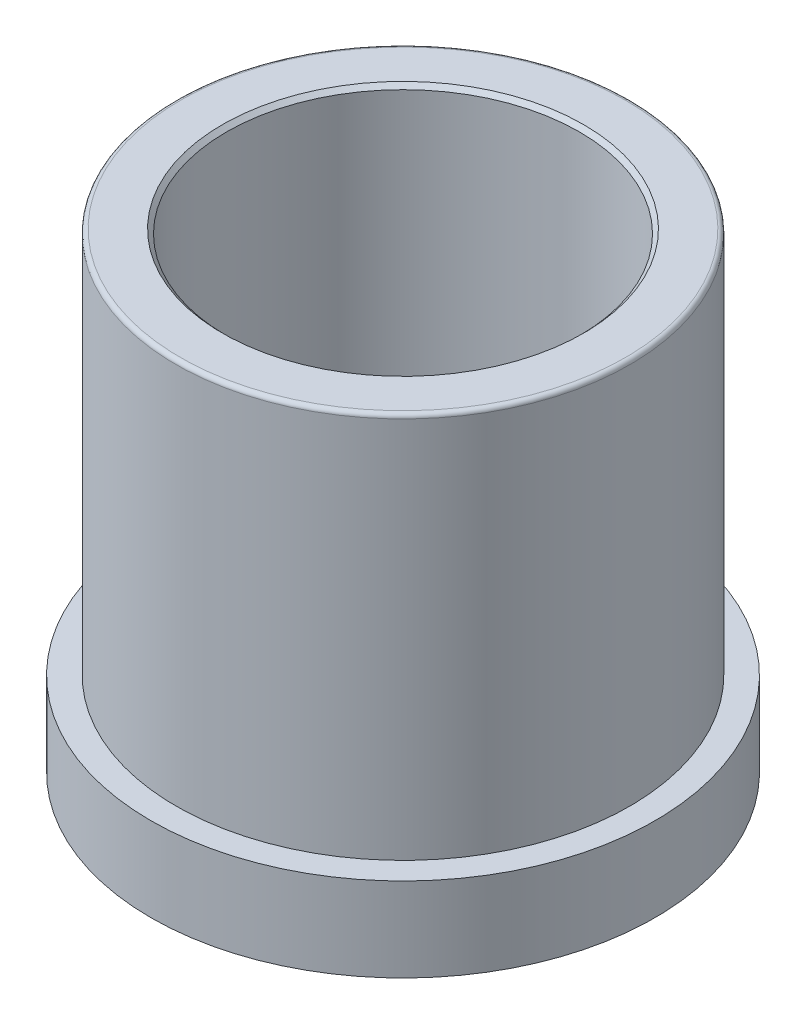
ISO-10303-21;
HEADER;
FILE_DESCRIPTION(('STEP AP214'),'2;1');
FILE_NAME('part.step','',(''),(''),'','','');
FILE_SCHEMA(('AUTOMOTIVE_DESIGN { 1 0 10303 214 1 1 1 1 }'));
ENDSEC;
DATA;
#1=APPLICATION_CONTEXT('core data for automotive mechanical design processes');
#2=APPLICATION_PROTOCOL_DEFINITION('international standard','automotive_design',2000,#1);
#3=PRODUCT_CONTEXT('',#1,'mechanical');
#4=PRODUCT('Part','Part','',(#3));
#5=PRODUCT_RELATED_PRODUCT_CATEGORY('part','',(#4));
#6=PRODUCT_DEFINITION_FORMATION('','',#4);
#7=PRODUCT_DEFINITION_CONTEXT('part definition',#1,'design');
#8=PRODUCT_DEFINITION('design','',#6,#7);
#9=PRODUCT_DEFINITION_SHAPE('','',#8);
#10=(LENGTH_UNIT() NAMED_UNIT(*) SI_UNIT(.MILLI.,.METRE.));
#11=(NAMED_UNIT(*) PLANE_ANGLE_UNIT() SI_UNIT($,.RADIAN.));
#12=(NAMED_UNIT(*) SI_UNIT($,.STERADIAN.) SOLID_ANGLE_UNIT());
#13=UNCERTAINTY_MEASURE_WITH_UNIT(LENGTH_MEASURE(1.E-05),#10,'distance_accuracy_value','');
#14=(GEOMETRIC_REPRESENTATION_CONTEXT(3) GLOBAL_UNCERTAINTY_ASSIGNED_CONTEXT((#13)) GLOBAL_UNIT_ASSIGNED_CONTEXT((#10,
#11,#12)) REPRESENTATION_CONTEXT('',''));
#15=CARTESIAN_POINT('',(0.,0.,0.));
#16=DIRECTION('',(0.,0.,1.));
#17=DIRECTION('',(1.,0.,0.));
#18=AXIS2_PLACEMENT_3D('',#15,#16,#17);
#19=CARTESIAN_POINT('',(0.,0.,0.));
#20=DIRECTION('',(0.,-1.,0.));
#21=DIRECTION('',(0.,0.,-1.));
#22=AXIS2_PLACEMENT_3D('',#19,#20,#21);
#23=CYLINDRICAL_SURFACE('',#22,27.);
#24=CARTESIAN_POINT('',(0.,45.5,0.));
#25=DIRECTION('',(0.,-1.,0.));
#26=DIRECTION('',(0.,0.,-1.));
#27=AXIS2_PLACEMENT_3D('',#24,#25,#26);
#28=CIRCLE('',#27,27.);
#29=CARTESIAN_POINT('',(0.,45.5,-27.));
#30=VERTEX_POINT('',#29);
#31=EDGE_CURVE('E21',#30,#30,#28,.T.);
#32=ORIENTED_EDGE('',*,*,#31,.T.);
#33=EDGE_LOOP('',(#32));
#34=FACE_BOUND('',#33,.T.);
#35=CARTESIAN_POINT('',(0.,0.,0.));
#36=DIRECTION('',(0.,-1.,0.));
#37=DIRECTION('',(0.,0.,-1.));
#38=AXIS2_PLACEMENT_3D('',#35,#36,#37);
#39=CIRCLE('',#38,27.);
#40=CARTESIAN_POINT('',(0.,0.,-27.));
#41=VERTEX_POINT('',#40);
#42=EDGE_CURVE('E49',#41,#41,#39,.T.);
#43=ORIENTED_EDGE('',*,*,#42,.F.);
#44=EDGE_LOOP('',(#43));
#45=FACE_BOUND('',#44,.T.);
#46=ADVANCED_FACE('F14',(#34,#45),#23,.T.);
#47=CARTESIAN_POINT('',(-27.,46.,0.));
#48=DIRECTION('',(0.,-1.,0.));
#49=DIRECTION('',(0.,0.,-1.));
#50=AXIS2_PLACEMENT_3D('',#47,#48,#49);
#51=PLANE('',#50);
#52=CARTESIAN_POINT('',(0.,46.,0.));
#53=DIRECTION('',(0.,-1.,0.));
#54=DIRECTION('',(0.,0.,-1.));
#55=AXIS2_PLACEMENT_3D('',#52,#53,#54);
#56=CIRCLE('',#55,26.5);
#57=CARTESIAN_POINT('',(0.,46.,-26.5));
#58=VERTEX_POINT('',#57);
#59=EDGE_CURVE('E9',#58,#58,#56,.F.);
#60=ORIENTED_EDGE('',*,*,#59,.T.);
#61=EDGE_LOOP('',(#60));
#62=FACE_BOUND('',#61,.T.);
#63=CARTESIAN_POINT('',(0.,46.,0.));
#64=DIRECTION('',(0.,-1.,0.));
#65=DIRECTION('',(0.,0.,-1.));
#66=AXIS2_PLACEMENT_3D('',#63,#64,#65);
#67=CIRCLE('',#66,21.5);
#68=CARTESIAN_POINT('',(0.,46.,-21.5));
#69=VERTEX_POINT('',#68);
#70=EDGE_CURVE('E37',#69,#69,#67,.T.);
#71=ORIENTED_EDGE('',*,*,#70,.T.);
#72=EDGE_LOOP('',(#71));
#73=FACE_BOUND('',#72,.T.);
#74=ADVANCED_FACE('F56',(#62,#73),#51,.F.);
#75=CARTESIAN_POINT('',(0.,0.,0.));
#76=DIRECTION('',(0.,-1.,0.));
#77=DIRECTION('',(0.,0.,-1.));
#78=AXIS2_PLACEMENT_3D('',#75,#76,#77);
#79=CYLINDRICAL_SURFACE('',#78,21.);
#80=CARTESIAN_POINT('',(0.,45.5,0.));
#81=DIRECTION('',(0.,-1.,0.));
#82=DIRECTION('',(0.,0.,-1.));
#83=AXIS2_PLACEMENT_3D('',#80,#81,#82);
#84=CIRCLE('',#83,21.);
#85=CARTESIAN_POINT('',(0.,45.5,-21.));
#86=VERTEX_POINT('',#85);
#87=EDGE_CURVE('E34',#86,#86,#84,.F.);
#88=ORIENTED_EDGE('',*,*,#87,.T.);
#89=EDGE_LOOP('',(#88));
#90=FACE_BOUND('',#89,.T.);
#91=CARTESIAN_POINT('',(0.,-10.,0.));
#92=DIRECTION('',(0.,-1.,0.));
#93=DIRECTION('',(0.,0.,-1.));
#94=AXIS2_PLACEMENT_3D('',#91,#92,#93);
#95=CIRCLE('',#94,21.);
#96=CARTESIAN_POINT('',(0.,-10.,-21.));
#97=VERTEX_POINT('',#96);
#98=EDGE_CURVE('E40',#97,#97,#95,.T.);
#99=ORIENTED_EDGE('',*,*,#98,.T.);
#100=EDGE_LOOP('',(#99));
#101=FACE_BOUND('',#100,.T.);
#102=ADVANCED_FACE('F63',(#90,#101),#79,.F.);
#103=CARTESIAN_POINT('',(0.,-10.15,0.));
#104=DIRECTION('',(0.,-1.,0.));
#105=DIRECTION('',(0.,0.,-1.));
#106=AXIS2_PLACEMENT_3D('',#103,#104,#105);
#107=CONICAL_SURFACE('',#106,21.1,0.588002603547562);
#108=CARTESIAN_POINT('',(0.,-10.36,0.));
#109=DIRECTION('',(0.,1.,0.));
#110=DIRECTION('',(0.,0.,1.));
#111=AXIS2_PLACEMENT_3D('',#108,#109,#110);
#112=CIRCLE('',#111,21.24);
#113=CARTESIAN_POINT('',(0.,-10.36,21.24));
#114=VERTEX_POINT('',#113);
#115=EDGE_CURVE('E25',#114,#114,#112,.F.);
#116=ORIENTED_EDGE('',*,*,#115,.T.);
#117=EDGE_LOOP('',(#116));
#118=FACE_BOUND('',#117,.T.);
#119=ORIENTED_EDGE('',*,*,#98,.F.);
#120=EDGE_LOOP('',(#119));
#121=FACE_BOUND('',#120,.T.);
#122=ADVANCED_FACE('F82',(#118,#121),#107,.F.);
#123=CARTESIAN_POINT('',(-21.1,-10.,0.));
#124=DIRECTION('',(0.,1.,0.));
#125=DIRECTION('',(0.,0.,1.));
#126=AXIS2_PLACEMENT_3D('',#123,#124,#125);
#127=PLANE('',#126);
#128=CARTESIAN_POINT('',(0.,-10.,0.));
#129=DIRECTION('',(0.,1.,0.));
#130=DIRECTION('',(0.,0.,1.));
#131=AXIS2_PLACEMENT_3D('',#128,#129,#130);
#132=CIRCLE('',#131,21.6);
#133=CARTESIAN_POINT('',(0.,-10.,21.6));
#134=VERTEX_POINT('',#133);
#135=EDGE_CURVE('E29',#134,#134,#132,.T.);
#136=ORIENTED_EDGE('',*,*,#135,.T.);
#137=EDGE_LOOP('',(#136));
#138=FACE_BOUND('',#137,.T.);
#139=CARTESIAN_POINT('',(0.,-10.,0.));
#140=DIRECTION('',(0.,-1.,0.));
#141=DIRECTION('',(0.,0.,-1.));
#142=AXIS2_PLACEMENT_3D('',#139,#140,#141);
#143=CIRCLE('',#142,30.);
#144=CARTESIAN_POINT('',(0.,-10.,-30.));
#145=VERTEX_POINT('',#144);
#146=EDGE_CURVE('E43',#145,#145,#143,.T.);
#147=ORIENTED_EDGE('',*,*,#146,.T.);
#148=EDGE_LOOP('',(#147));
#149=FACE_BOUND('',#148,.T.);
#150=ADVANCED_FACE('F85',(#138,#149),#127,.F.);
#151=CARTESIAN_POINT('',(0.,0.,0.));
#152=DIRECTION('',(0.,-1.,0.));
#153=DIRECTION('',(0.,0.,-1.));
#154=AXIS2_PLACEMENT_3D('',#151,#152,#153);
#155=CYLINDRICAL_SURFACE('',#154,30.);
#156=ORIENTED_EDGE('',*,*,#146,.F.);
#157=EDGE_LOOP('',(#156));
#158=FACE_BOUND('',#157,.T.);
#159=CARTESIAN_POINT('',(0.,0.,0.));
#160=DIRECTION('',(0.,-1.,0.));
#161=DIRECTION('',(0.,0.,-1.));
#162=AXIS2_PLACEMENT_3D('',#159,#160,#161);
#163=CIRCLE('',#162,30.);
#164=CARTESIAN_POINT('',(0.,0.,-30.));
#165=VERTEX_POINT('',#164);
#166=EDGE_CURVE('E46',#165,#165,#163,.T.);
#167=ORIENTED_EDGE('',*,*,#166,.T.);
#168=EDGE_LOOP('',(#167));
#169=FACE_BOUND('',#168,.T.);
#170=ADVANCED_FACE('F97',(#158,#169),#155,.T.);
#171=CARTESIAN_POINT('',(-30.,0.,0.));
#172=DIRECTION('',(0.,-1.,0.));
#173=DIRECTION('',(0.,0.,-1.));
#174=AXIS2_PLACEMENT_3D('',#171,#172,#173);
#175=PLANE('',#174);
#176=ORIENTED_EDGE('',*,*,#166,.F.);
#177=EDGE_LOOP('',(#176));
#178=FACE_BOUND('',#177,.T.);
#179=ORIENTED_EDGE('',*,*,#42,.T.);
#180=EDGE_LOOP('',(#179));
#181=FACE_BOUND('',#180,.T.);
#182=ADVANCED_FACE('F53',(#178,#181),#175,.F.);
#183=CARTESIAN_POINT('',(0.,46.,0.));
#184=DIRECTION('',(0.,1.,0.));
#185=DIRECTION('',(0.,0.,1.));
#186=AXIS2_PLACEMENT_3D('',#183,#184,#185);
#187=CONICAL_SURFACE('',#186,21.5,0.785398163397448);
#188=ORIENTED_EDGE('',*,*,#87,.F.);
#189=EDGE_LOOP('',(#188));
#190=FACE_BOUND('',#189,.T.);
#191=ORIENTED_EDGE('',*,*,#70,.F.);
#192=EDGE_LOOP('',(#191));
#193=FACE_BOUND('',#192,.T.);
#194=ADVANCED_FACE('F67',(#190,#193),#187,.F.);
#195=CARTESIAN_POINT('',(0.,-10.5,0.));
#196=DIRECTION('',(0.,1.,0.));
#197=DIRECTION('',(0.,0.,1.));
#198=AXIS2_PLACEMENT_3D('',#195,#196,#197);
#199=CONICAL_SURFACE('',#198,21.1,0.785398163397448);
#200=ORIENTED_EDGE('',*,*,#135,.F.);
#201=EDGE_LOOP('',(#200));
#202=FACE_BOUND('',#201,.T.);
#203=ORIENTED_EDGE('',*,*,#115,.F.);
#204=EDGE_LOOP('',(#203));
#205=FACE_BOUND('',#204,.T.);
#206=ADVANCED_FACE('F69',(#202,#205),#199,.T.);
#207=CARTESIAN_POINT('',(0.,45.5,0.));
#208=DIRECTION('',(0.,-1.,0.));
#209=DIRECTION('',(0.,0.,-1.));
#210=AXIS2_PLACEMENT_3D('',#207,#208,#209);
#211=TOROIDAL_SURFACE('',#210,26.5,0.5);
#212=ORIENTED_EDGE('',*,*,#59,.F.);
#213=EDGE_LOOP('',(#212));
#214=FACE_BOUND('',#213,.T.);
#215=ORIENTED_EDGE('',*,*,#31,.F.);
#216=EDGE_LOOP('',(#215));
#217=FACE_BOUND('',#216,.T.);
#218=ADVANCED_FACE('F16',(#214,#217),#211,.T.);
#219=CLOSED_SHELL('',(#46,#74,#102,#122,#150,#170,#182,#194,#206,#218));
#220=MANIFOLD_SOLID_BREP('B1',#219);
#221=ADVANCED_BREP_SHAPE_REPRESENTATION('',(#18,#220),#14);
#222=SHAPE_DEFINITION_REPRESENTATION(#9,#221);
ENDSEC;
END-ISO-10303-21;
